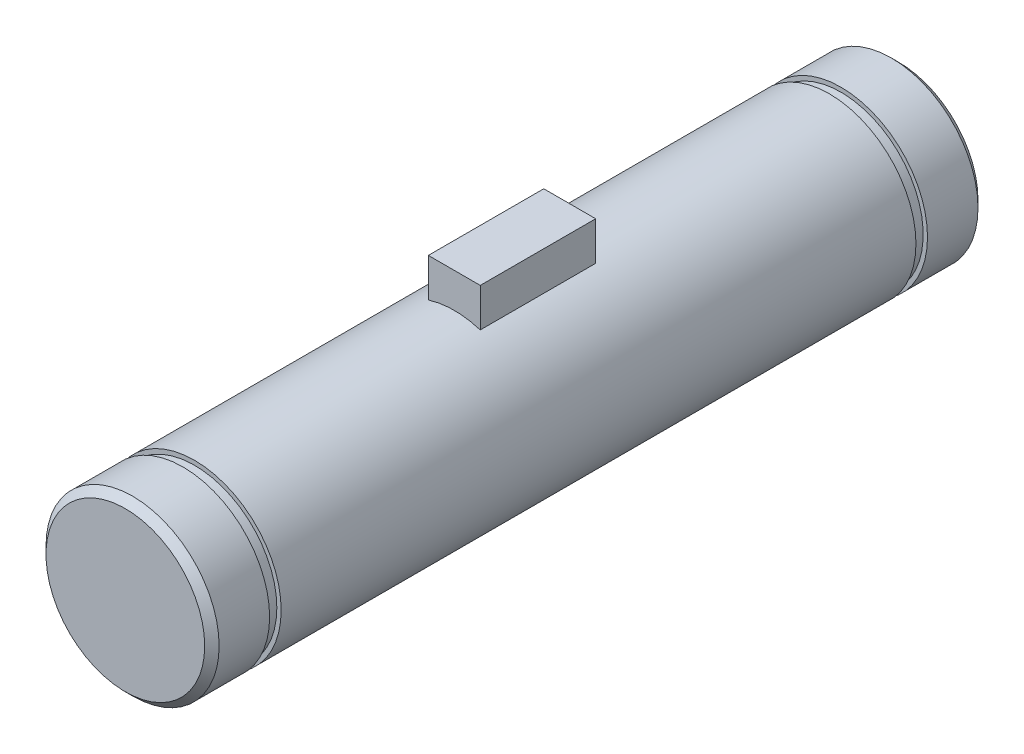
ISO-10303-21;
HEADER;
FILE_DESCRIPTION(('STEP AP214'),'2;1');
FILE_NAME('part.step','',(''),(''),'','','');
FILE_SCHEMA(('AUTOMOTIVE_DESIGN { 1 0 10303 214 1 1 1 1 }'));
ENDSEC;
DATA;
#1=APPLICATION_CONTEXT('core data for automotive mechanical design processes');
#2=APPLICATION_PROTOCOL_DEFINITION('international standard','automotive_design',2000,#1);
#3=PRODUCT_CONTEXT('',#1,'mechanical');
#4=PRODUCT('Part','Part','',(#3));
#5=PRODUCT_RELATED_PRODUCT_CATEGORY('part','',(#4));
#6=PRODUCT_DEFINITION_FORMATION('','',#4);
#7=PRODUCT_DEFINITION_CONTEXT('part definition',#1,'design');
#8=PRODUCT_DEFINITION('design','',#6,#7);
#9=PRODUCT_DEFINITION_SHAPE('','',#8);
#10=(LENGTH_UNIT() NAMED_UNIT(*) SI_UNIT(.MILLI.,.METRE.));
#11=(NAMED_UNIT(*) PLANE_ANGLE_UNIT() SI_UNIT($,.RADIAN.));
#12=(NAMED_UNIT(*) SI_UNIT($,.STERADIAN.) SOLID_ANGLE_UNIT());
#13=UNCERTAINTY_MEASURE_WITH_UNIT(LENGTH_MEASURE(1.E-05),#10,'distance_accuracy_value','');
#14=(GEOMETRIC_REPRESENTATION_CONTEXT(3) GLOBAL_UNCERTAINTY_ASSIGNED_CONTEXT((#13)) GLOBAL_UNIT_ASSIGNED_CONTEXT((#10,
#11,#12)) REPRESENTATION_CONTEXT('',''));
#15=CARTESIAN_POINT('',(0.,0.,0.));
#16=DIRECTION('',(0.,0.,1.));
#17=DIRECTION('',(1.,0.,0.));
#18=AXIS2_PLACEMENT_3D('',#15,#16,#17);
#19=CARTESIAN_POINT('',(0.,0.,26.8));
#20=DIRECTION('',(0.,0.,-1.));
#21=DIRECTION('',(-1.,0.,0.));
#22=AXIS2_PLACEMENT_3D('',#19,#20,#21);
#23=CYLINDRICAL_SURFACE('',#22,3.);
#24=CARTESIAN_POINT('',(0.,0.,15.4));
#25=DIRECTION('',(0.,0.,-1.));
#26=DIRECTION('',(-1.,0.,0.));
#27=AXIS2_PLACEMENT_3D('',#24,#25,#26);
#28=CIRCLE('',#27,3.);
#29=CARTESIAN_POINT('',(-0.9,2.86181760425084,15.4));
#30=VERTEX_POINT('',#29);
#31=CARTESIAN_POINT('',(0.9,2.86181760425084,15.4));
#32=VERTEX_POINT('',#31);
#33=EDGE_CURVE('E114',#30,#32,#28,.T.);
#34=ORIENTED_EDGE('',*,*,#33,.F.);
#35=DIRECTION('',(0.,0.,-1.));
#36=VECTOR('',#35,1.);
#37=CARTESIAN_POINT('',(-0.9,2.86181760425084,26.8));
#38=LINE('',#37,#36);
#39=CARTESIAN_POINT('',(-0.9,2.86181760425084,11.4));
#40=VERTEX_POINT('',#39);
#41=EDGE_CURVE('E59',#30,#40,#38,.T.);
#42=ORIENTED_EDGE('',*,*,#41,.T.);
#43=CARTESIAN_POINT('',(0.,0.,11.4));
#44=DIRECTION('',(0.,0.,-1.));
#45=DIRECTION('',(-1.,0.,0.));
#46=AXIS2_PLACEMENT_3D('',#43,#44,#45);
#47=CIRCLE('',#46,3.);
#48=CARTESIAN_POINT('',(0.9,2.86181760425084,11.4));
#49=VERTEX_POINT('',#48);
#50=EDGE_CURVE('E106',#40,#49,#47,.T.);
#51=ORIENTED_EDGE('',*,*,#50,.T.);
#52=DIRECTION('',(0.,0.,-1.));
#53=VECTOR('',#52,1.);
#54=CARTESIAN_POINT('',(0.9,2.86181760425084,26.8));
#55=LINE('',#54,#53);
#56=EDGE_CURVE('E111',#49,#32,#55,.F.);
#57=ORIENTED_EDGE('',*,*,#56,.T.);
#58=EDGE_LOOP('',(#34,#42,#51,#57));
#59=FACE_BOUND('',#58,.T.);
#60=CARTESIAN_POINT('',(0.,0.,2.4));
#61=DIRECTION('',(0.,0.,-1.));
#62=DIRECTION('',(-1.,0.,0.));
#63=AXIS2_PLACEMENT_3D('',#60,#61,#62);
#64=CIRCLE('',#63,3.);
#65=CARTESIAN_POINT('',(-3.,0.,2.4));
#66=VERTEX_POINT('',#65);
#67=EDGE_CURVE('E103',#66,#66,#64,.T.);
#68=ORIENTED_EDGE('',*,*,#67,.F.);
#69=EDGE_LOOP('',(#68));
#70=FACE_BOUND('',#69,.T.);
#71=CARTESIAN_POINT('',(0.,0.,24.4));
#72=DIRECTION('',(0.,0.,1.));
#73=DIRECTION('',(1.,0.,0.));
#74=AXIS2_PLACEMENT_3D('',#71,#72,#73);
#75=CIRCLE('',#74,3.);
#76=CARTESIAN_POINT('',(3.,0.,24.4));
#77=VERTEX_POINT('',#76);
#78=EDGE_CURVE('E120',#77,#77,#75,.T.);
#79=ORIENTED_EDGE('',*,*,#78,.F.);
#80=EDGE_LOOP('',(#79));
#81=FACE_BOUND('',#80,.T.);
#82=ADVANCED_FACE('F36',(#59,#70,#81),#23,.T.);
#83=CARTESIAN_POINT('',(0.9,4.2,15.4));
#84=DIRECTION('',(1.,0.,0.));
#85=DIRECTION('',(0.,1.,0.));
#86=AXIS2_PLACEMENT_3D('',#83,#84,#85);
#87=PLANE('',#86);
#88=ORIENTED_EDGE('',*,*,#56,.F.);
#89=DIRECTION('',(0.,-1.,0.));
#90=VECTOR('',#89,1.);
#91=CARTESIAN_POINT('',(0.9,4.2,11.4));
#92=LINE('',#91,#90);
#93=CARTESIAN_POINT('',(0.9,4.2,11.4));
#94=VERTEX_POINT('',#93);
#95=EDGE_CURVE('E51',#94,#49,#92,.T.);
#96=ORIENTED_EDGE('',*,*,#95,.F.);
#97=DIRECTION('',(0.,0.,-1.));
#98=VECTOR('',#97,1.);
#99=CARTESIAN_POINT('',(0.9,4.2,15.4));
#100=LINE('',#99,#98);
#101=CARTESIAN_POINT('',(0.9,4.2,15.4));
#102=VERTEX_POINT('',#101);
#103=EDGE_CURVE('E92',#102,#94,#100,.T.);
#104=ORIENTED_EDGE('',*,*,#103,.F.);
#105=DIRECTION('',(0.,-1.,0.));
#106=VECTOR('',#105,1.);
#107=CARTESIAN_POINT('',(0.9,4.2,15.4));
#108=LINE('',#107,#106);
#109=EDGE_CURVE('E93',#102,#32,#108,.T.);
#110=ORIENTED_EDGE('',*,*,#109,.T.);
#111=EDGE_LOOP('',(#88,#96,#104,#110));
#112=FACE_BOUND('',#111,.T.);
#113=ADVANCED_FACE('F144',(#112),#87,.T.);
#114=CARTESIAN_POINT('',(-0.9,0.,15.4));
#115=DIRECTION('',(-1.,0.,0.));
#116=DIRECTION('',(0.,0.,1.));
#117=AXIS2_PLACEMENT_3D('',#114,#115,#116);
#118=PLANE('',#117);
#119=ORIENTED_EDGE('',*,*,#41,.F.);
#120=DIRECTION('',(0.,1.,0.));
#121=VECTOR('',#120,1.);
#122=CARTESIAN_POINT('',(-0.9,0.,15.4));
#123=LINE('',#122,#121);
#124=CARTESIAN_POINT('',(-0.9,4.2,15.4));
#125=VERTEX_POINT('',#124);
#126=EDGE_CURVE('E77',#30,#125,#123,.T.);
#127=ORIENTED_EDGE('',*,*,#126,.T.);
#128=DIRECTION('',(0.,0.,-1.));
#129=VECTOR('',#128,1.);
#130=CARTESIAN_POINT('',(-0.9,4.2,15.4));
#131=LINE('',#130,#129);
#132=CARTESIAN_POINT('',(-0.9,4.2,11.4));
#133=VERTEX_POINT('',#132);
#134=EDGE_CURVE('E80',#125,#133,#131,.T.);
#135=ORIENTED_EDGE('',*,*,#134,.T.);
#136=DIRECTION('',(0.,1.,0.));
#137=VECTOR('',#136,1.);
#138=CARTESIAN_POINT('',(-0.9,0.,11.4));
#139=LINE('',#138,#137);
#140=EDGE_CURVE('E101',#40,#133,#139,.T.);
#141=ORIENTED_EDGE('',*,*,#140,.F.);
#142=EDGE_LOOP('',(#119,#127,#135,#141));
#143=FACE_BOUND('',#142,.T.);
#144=ADVANCED_FACE('F79',(#143),#118,.T.);
#145=CARTESIAN_POINT('',(0.,0.,15.4));
#146=DIRECTION('',(0.,0.,-1.));
#147=DIRECTION('',(-1.,0.,0.));
#148=AXIS2_PLACEMENT_3D('',#145,#146,#147);
#149=PLANE('',#148);
#150=ORIENTED_EDGE('',*,*,#126,.F.);
#151=ORIENTED_EDGE('',*,*,#33,.T.);
#152=ORIENTED_EDGE('',*,*,#109,.F.);
#153=DIRECTION('',(1.,0.,0.));
#154=VECTOR('',#153,1.);
#155=CARTESIAN_POINT('',(-0.9,4.2,15.4));
#156=LINE('',#155,#154);
#157=EDGE_CURVE('E85',#125,#102,#156,.T.);
#158=ORIENTED_EDGE('',*,*,#157,.F.);
#159=EDGE_LOOP('',(#150,#151,#152,#158));
#160=FACE_BOUND('',#159,.T.);
#161=ADVANCED_FACE('F95',(#160),#149,.F.);
#162=CARTESIAN_POINT('',(0.,0.,11.4));
#163=DIRECTION('',(0.,0.,-1.));
#164=DIRECTION('',(-1.,0.,0.));
#165=AXIS2_PLACEMENT_3D('',#162,#163,#164);
#166=PLANE('',#165);
#167=ORIENTED_EDGE('',*,*,#50,.F.);
#168=ORIENTED_EDGE('',*,*,#140,.T.);
#169=DIRECTION('',(1.,0.,0.));
#170=VECTOR('',#169,1.);
#171=CARTESIAN_POINT('',(-0.9,4.2,11.4));
#172=LINE('',#171,#170);
#173=EDGE_CURVE('E91',#133,#94,#172,.T.);
#174=ORIENTED_EDGE('',*,*,#173,.T.);
#175=ORIENTED_EDGE('',*,*,#95,.T.);
#176=EDGE_LOOP('',(#167,#168,#174,#175));
#177=FACE_BOUND('',#176,.T.);
#178=ADVANCED_FACE('F220',(#177),#166,.T.);
#179=CARTESIAN_POINT('',(-0.9,4.2,15.4));
#180=DIRECTION('',(0.,1.,0.));
#181=DIRECTION('',(0.,0.,1.));
#182=AXIS2_PLACEMENT_3D('',#179,#180,#181);
#183=PLANE('',#182);
#184=ORIENTED_EDGE('',*,*,#173,.F.);
#185=ORIENTED_EDGE('',*,*,#134,.F.);
#186=ORIENTED_EDGE('',*,*,#157,.T.);
#187=ORIENTED_EDGE('',*,*,#103,.T.);
#188=EDGE_LOOP('',(#184,#185,#186,#187));
#189=FACE_BOUND('',#188,.T.);
#190=ADVANCED_FACE('F89',(#189),#183,.T.);
#191=CARTESIAN_POINT('',(0.,0.,2.4));
#192=DIRECTION('',(0.,0.,-1.));
#193=DIRECTION('',(-1.,0.,0.));
#194=AXIS2_PLACEMENT_3D('',#191,#192,#193);
#195=PLANE('',#194);
#196=CARTESIAN_POINT('',(0.,0.,2.4));
#197=DIRECTION('',(0.,0.,-1.));
#198=DIRECTION('',(-1.,0.,0.));
#199=AXIS2_PLACEMENT_3D('',#196,#197,#198);
#200=CIRCLE('',#199,2.85);
#201=CARTESIAN_POINT('',(-2.85,0.,2.4));
#202=VERTEX_POINT('',#201);
#203=EDGE_CURVE('E176',#202,#202,#200,.T.);
#204=ORIENTED_EDGE('',*,*,#203,.F.);
#205=EDGE_LOOP('',(#204));
#206=FACE_BOUND('',#205,.T.);
#207=ORIENTED_EDGE('',*,*,#67,.T.);
#208=EDGE_LOOP('',(#207));
#209=FACE_BOUND('',#208,.T.);
#210=ADVANCED_FACE('F211',(#206,#209),#195,.T.);
#211=CARTESIAN_POINT('',(0.,0.,2.));
#212=DIRECTION('',(0.,0.,-1.));
#213=DIRECTION('',(-1.,0.,0.));
#214=AXIS2_PLACEMENT_3D('',#211,#212,#213);
#215=PLANE('',#214);
#216=CARTESIAN_POINT('',(0.,0.,2.));
#217=DIRECTION('',(0.,0.,-1.));
#218=DIRECTION('',(-1.,0.,0.));
#219=AXIS2_PLACEMENT_3D('',#216,#217,#218);
#220=CIRCLE('',#219,2.85);
#221=CARTESIAN_POINT('',(-2.85,0.,2.));
#222=VERTEX_POINT('',#221);
#223=EDGE_CURVE('E124',#222,#222,#220,.T.);
#224=ORIENTED_EDGE('',*,*,#223,.T.);
#225=EDGE_LOOP('',(#224));
#226=FACE_BOUND('',#225,.T.);
#227=CARTESIAN_POINT('',(0.,0.,2.));
#228=DIRECTION('',(0.,0.,-1.));
#229=DIRECTION('',(-1.,0.,0.));
#230=AXIS2_PLACEMENT_3D('',#227,#228,#229);
#231=CIRCLE('',#230,3.);
#232=CARTESIAN_POINT('',(-3.,0.,2.));
#233=VERTEX_POINT('',#232);
#234=EDGE_CURVE('E174',#233,#233,#231,.T.);
#235=ORIENTED_EDGE('',*,*,#234,.F.);
#236=EDGE_LOOP('',(#235));
#237=FACE_BOUND('',#236,.T.);
#238=ADVANCED_FACE('F209',(#226,#237),#215,.F.);
#239=CARTESIAN_POINT('',(0.,0.,2.4));
#240=DIRECTION('',(0.,0.,-1.));
#241=DIRECTION('',(-1.,0.,0.));
#242=AXIS2_PLACEMENT_3D('',#239,#240,#241);
#243=CYLINDRICAL_SURFACE('',#242,2.85);
#244=ORIENTED_EDGE('',*,*,#203,.T.);
#245=EDGE_LOOP('',(#244));
#246=FACE_BOUND('',#245,.T.);
#247=ORIENTED_EDGE('',*,*,#223,.F.);
#248=EDGE_LOOP('',(#247));
#249=FACE_BOUND('',#248,.T.);
#250=ADVANCED_FACE('F168',(#246,#249),#243,.T.);
#251=CARTESIAN_POINT('',(0.,0.,0.));
#252=DIRECTION('',(0.,0.,1.));
#253=DIRECTION('',(1.,0.,0.));
#254=AXIS2_PLACEMENT_3D('',#251,#252,#253);
#255=PLANE('',#254);
#256=CARTESIAN_POINT('',(0.,0.,0.));
#257=DIRECTION('',(0.,0.,1.));
#258=DIRECTION('',(1.,0.,0.));
#259=AXIS2_PLACEMENT_3D('',#256,#257,#258);
#260=CIRCLE('',#259,2.75);
#261=CARTESIAN_POINT('',(2.75,0.,0.));
#262=VERTEX_POINT('',#261);
#263=EDGE_CURVE('E127',#262,#262,#260,.F.);
#264=ORIENTED_EDGE('',*,*,#263,.T.);
#265=EDGE_LOOP('',(#264));
#266=FACE_BOUND('',#265,.T.);
#267=ADVANCED_FACE('F159',(#266),#255,.F.);
#268=CARTESIAN_POINT('',(0.,0.,0.249999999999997));
#269=DIRECTION('',(0.,0.,1.));
#270=DIRECTION('',(1.,0.,0.));
#271=AXIS2_PLACEMENT_3D('',#268,#269,#270);
#272=CIRCLE('',#271,3.);
#273=CARTESIAN_POINT('',(3.,0.,0.249999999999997));
#274=VERTEX_POINT('',#273);
#275=EDGE_CURVE('E116',#274,#274,#272,.T.);
#276=ORIENTED_EDGE('',*,*,#275,.T.);
#277=EDGE_LOOP('',(#276));
#278=FACE_BOUND('',#277,.T.);
#279=ORIENTED_EDGE('',*,*,#234,.T.);
#280=EDGE_LOOP('',(#279));
#281=FACE_BOUND('',#280,.T.);
#282=ADVANCED_FACE('F147',(#278,#281),#23,.T.);
#283=CARTESIAN_POINT('',(0.,0.,24.4));
#284=DIRECTION('',(0.,0.,1.));
#285=DIRECTION('',(1.,0.,0.));
#286=AXIS2_PLACEMENT_3D('',#283,#284,#285);
#287=PLANE('',#286);
#288=CARTESIAN_POINT('',(0.,0.,24.4));
#289=DIRECTION('',(0.,0.,1.));
#290=DIRECTION('',(1.,0.,0.));
#291=AXIS2_PLACEMENT_3D('',#288,#289,#290);
#292=CIRCLE('',#291,2.85);
#293=CARTESIAN_POINT('',(2.85,0.,24.4));
#294=VERTEX_POINT('',#293);
#295=EDGE_CURVE('E121',#294,#294,#292,.T.);
#296=ORIENTED_EDGE('',*,*,#295,.F.);
#297=EDGE_LOOP('',(#296));
#298=FACE_BOUND('',#297,.T.);
#299=ORIENTED_EDGE('',*,*,#78,.T.);
#300=EDGE_LOOP('',(#299));
#301=FACE_BOUND('',#300,.T.);
#302=ADVANCED_FACE('F158',(#298,#301),#287,.T.);
#303=CARTESIAN_POINT('',(0.,0.,24.8));
#304=DIRECTION('',(0.,0.,1.));
#305=DIRECTION('',(1.,0.,0.));
#306=AXIS2_PLACEMENT_3D('',#303,#304,#305);
#307=PLANE('',#306);
#308=CARTESIAN_POINT('',(0.,0.,24.8));
#309=DIRECTION('',(0.,0.,1.));
#310=DIRECTION('',(1.,0.,0.));
#311=AXIS2_PLACEMENT_3D('',#308,#309,#310);
#312=CIRCLE('',#311,2.85);
#313=CARTESIAN_POINT('',(2.85,0.,24.8));
#314=VERTEX_POINT('',#313);
#315=EDGE_CURVE('E184',#314,#314,#312,.T.);
#316=ORIENTED_EDGE('',*,*,#315,.T.);
#317=EDGE_LOOP('',(#316));
#318=FACE_BOUND('',#317,.T.);
#319=CARTESIAN_POINT('',(0.,0.,24.8));
#320=DIRECTION('',(0.,0.,1.));
#321=DIRECTION('',(1.,0.,0.));
#322=AXIS2_PLACEMENT_3D('',#319,#320,#321);
#323=CIRCLE('',#322,3.);
#324=CARTESIAN_POINT('',(3.,0.,24.8));
#325=VERTEX_POINT('',#324);
#326=EDGE_CURVE('E117',#325,#325,#323,.T.);
#327=ORIENTED_EDGE('',*,*,#326,.F.);
#328=EDGE_LOOP('',(#327));
#329=FACE_BOUND('',#328,.T.);
#330=ADVANCED_FACE('F165',(#318,#329),#307,.F.);
#331=CARTESIAN_POINT('',(0.,0.,24.4));
#332=DIRECTION('',(0.,0.,1.));
#333=DIRECTION('',(1.,0.,0.));
#334=AXIS2_PLACEMENT_3D('',#331,#332,#333);
#335=CYLINDRICAL_SURFACE('',#334,2.85);
#336=ORIENTED_EDGE('',*,*,#295,.T.);
#337=EDGE_LOOP('',(#336));
#338=FACE_BOUND('',#337,.T.);
#339=ORIENTED_EDGE('',*,*,#315,.F.);
#340=EDGE_LOOP('',(#339));
#341=FACE_BOUND('',#340,.T.);
#342=ADVANCED_FACE('F190',(#338,#341),#335,.T.);
#343=CARTESIAN_POINT('',(0.,0.,26.8));
#344=DIRECTION('',(0.,0.,1.));
#345=DIRECTION('',(1.,0.,0.));
#346=AXIS2_PLACEMENT_3D('',#343,#344,#345);
#347=PLANE('',#346);
#348=CARTESIAN_POINT('',(0.,0.,26.8));
#349=DIRECTION('',(0.,0.,1.));
#350=DIRECTION('',(1.,0.,0.));
#351=AXIS2_PLACEMENT_3D('',#348,#349,#350);
#352=CIRCLE('',#351,2.75);
#353=CARTESIAN_POINT('',(2.75,0.,26.8));
#354=VERTEX_POINT('',#353);
#355=EDGE_CURVE('E44',#354,#354,#352,.T.);
#356=ORIENTED_EDGE('',*,*,#355,.T.);
#357=EDGE_LOOP('',(#356));
#358=FACE_BOUND('',#357,.T.);
#359=ADVANCED_FACE('F132',(#358),#347,.T.);
#360=CARTESIAN_POINT('',(0.,0.,26.55));
#361=DIRECTION('',(0.,0.,1.));
#362=DIRECTION('',(1.,0.,0.));
#363=AXIS2_PLACEMENT_3D('',#360,#361,#362);
#364=CIRCLE('',#363,3.);
#365=CARTESIAN_POINT('',(3.,0.,26.55));
#366=VERTEX_POINT('',#365);
#367=EDGE_CURVE('E11',#366,#366,#364,.F.);
#368=ORIENTED_EDGE('',*,*,#367,.T.);
#369=EDGE_LOOP('',(#368));
#370=FACE_BOUND('',#369,.T.);
#371=ORIENTED_EDGE('',*,*,#326,.T.);
#372=EDGE_LOOP('',(#371));
#373=FACE_BOUND('',#372,.T.);
#374=ADVANCED_FACE('F140',(#370,#373),#23,.T.);
#375=CARTESIAN_POINT('',(0.,0.,0.249999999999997));
#376=DIRECTION('',(0.,0.,1.));
#377=DIRECTION('',(1.,0.,0.));
#378=AXIS2_PLACEMENT_3D('',#375,#376,#377);
#379=CONICAL_SURFACE('',#378,3.,0.785398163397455);
#380=ORIENTED_EDGE('',*,*,#263,.F.);
#381=EDGE_LOOP('',(#380));
#382=FACE_BOUND('',#381,.T.);
#383=ORIENTED_EDGE('',*,*,#275,.F.);
#384=EDGE_LOOP('',(#383));
#385=FACE_BOUND('',#384,.T.);
#386=ADVANCED_FACE('F135',(#382,#385),#379,.T.);
#387=CARTESIAN_POINT('',(0.,0.,26.8));
#388=DIRECTION('',(0.,0.,-1.));
#389=DIRECTION('',(-1.,0.,0.));
#390=AXIS2_PLACEMENT_3D('',#387,#388,#389);
#391=CONICAL_SURFACE('',#390,2.75,0.785398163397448);
#392=ORIENTED_EDGE('',*,*,#367,.F.);
#393=EDGE_LOOP('',(#392));
#394=FACE_BOUND('',#393,.T.);
#395=ORIENTED_EDGE('',*,*,#355,.F.);
#396=EDGE_LOOP('',(#395));
#397=FACE_BOUND('',#396,.T.);
#398=ADVANCED_FACE('F38',(#394,#397),#391,.T.);
#399=CLOSED_SHELL('',(#82,#113,#144,#161,#178,#190,#210,#238,#250,#267,#282,#302,#330,#342,#359,
#374,#386,#398));
#400=MANIFOLD_SOLID_BREP('B2',#399);
#401=ADVANCED_BREP_SHAPE_REPRESENTATION('',(#18,#400),#14);
#402=SHAPE_DEFINITION_REPRESENTATION(#9,#401);
ENDSEC;
END-ISO-10303-21;
